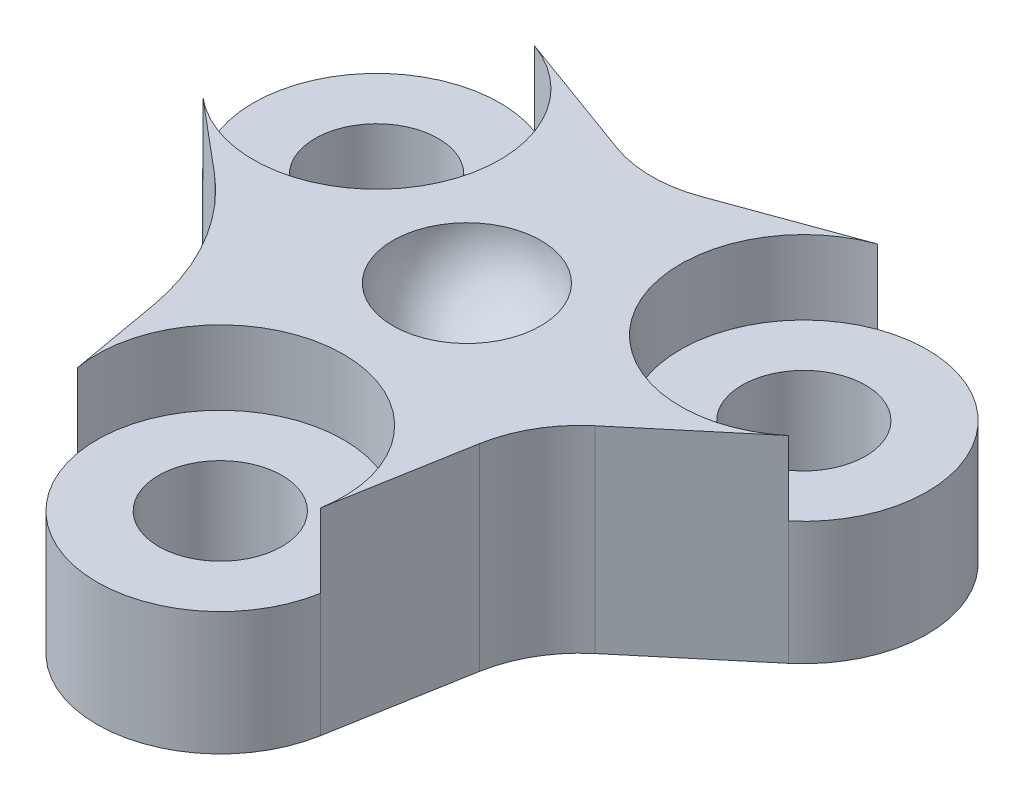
ISO-10303-21;
HEADER;
FILE_DESCRIPTION(('STEP AP214'),'2;1');
FILE_NAME('part.step','',(''),(''),'','','');
FILE_SCHEMA(('AUTOMOTIVE_DESIGN { 1 0 10303 214 1 1 1 1 }'));
ENDSEC;
DATA;
#1=APPLICATION_CONTEXT('core data for automotive mechanical design processes');
#2=APPLICATION_PROTOCOL_DEFINITION('international standard','automotive_design',2000,#1);
#3=PRODUCT_CONTEXT('',#1,'mechanical');
#4=PRODUCT('Part','Part','',(#3));
#5=PRODUCT_RELATED_PRODUCT_CATEGORY('part','',(#4));
#6=PRODUCT_DEFINITION_FORMATION('','',#4);
#7=PRODUCT_DEFINITION_CONTEXT('part definition',#1,'design');
#8=PRODUCT_DEFINITION('design','',#6,#7);
#9=PRODUCT_DEFINITION_SHAPE('','',#8);
#10=(LENGTH_UNIT() NAMED_UNIT(*) SI_UNIT(.MILLI.,.METRE.));
#11=(NAMED_UNIT(*) PLANE_ANGLE_UNIT() SI_UNIT($,.RADIAN.));
#12=(NAMED_UNIT(*) SI_UNIT($,.STERADIAN.) SOLID_ANGLE_UNIT());
#13=UNCERTAINTY_MEASURE_WITH_UNIT(LENGTH_MEASURE(1.E-05),#10,'distance_accuracy_value','');
#14=(GEOMETRIC_REPRESENTATION_CONTEXT(3) GLOBAL_UNCERTAINTY_ASSIGNED_CONTEXT((#13)) GLOBAL_UNIT_ASSIGNED_CONTEXT((#10,
#11,#12)) REPRESENTATION_CONTEXT('',''));
#15=CARTESIAN_POINT('',(0.,0.,0.));
#16=DIRECTION('',(0.,0.,1.));
#17=DIRECTION('',(1.,0.,0.));
#18=AXIS2_PLACEMENT_3D('',#15,#16,#17);
#19=CARTESIAN_POINT('',(0.,8.,10.));
#20=DIRECTION('',(0.,1.,0.));
#21=DIRECTION('',(1.,0.,0.));
#22=AXIS2_PLACEMENT_3D('',#19,#20,#21);
#23=PLANE('',#22);
#24=CARTESIAN_POINT('',(0.,8.,10.));
#25=DIRECTION('',(0.,1.,0.));
#26=DIRECTION('',(0.,0.,1.));
#27=AXIS2_PLACEMENT_3D('',#24,#25,#26);
#28=CIRCLE('',#27,5.);
#29=CARTESIAN_POINT('',(4.92403876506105,8.,10.8682408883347));
#30=VERTEX_POINT('',#29);
#31=CARTESIAN_POINT('',(-4.92403876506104,8.,10.8682408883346));
#32=VERTEX_POINT('',#31);
#33=EDGE_CURVE('E549',#30,#32,#28,.T.);
#34=ORIENTED_EDGE('',*,*,#33,.F.);
#35=DIRECTION('',(0.17364817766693,0.,-0.984807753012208));
#36=VECTOR('',#35,1.);
#37=CARTESIAN_POINT('',(4.92403876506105,8.,10.8682408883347));
#38=LINE('',#37,#36);
#39=CARTESIAN_POINT('',(5.8923613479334,8.,5.3766106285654));
#40=VERTEX_POINT('',#39);
#41=EDGE_CURVE('E220',#30,#40,#38,.T.);
#42=ORIENTED_EDGE('',*,*,#41,.T.);
#43=CARTESIAN_POINT('',(10.8164001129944,8.,6.24485151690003));
#44=DIRECTION('',(0.,-1.,0.));
#45=DIRECTION('',(-1.,0.,0.));
#46=AXIS2_PLACEMENT_3D('',#43,#44,#45);
#47=CIRCLE('',#46,5.);
#48=CARTESIAN_POINT('',(7.60246206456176,8.,2.41462930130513));
#49=VERTEX_POINT('',#48);
#50=EDGE_CURVE('E567',#40,#49,#47,.T.);
#51=ORIENTED_EDGE('',*,*,#50,.T.);
#52=DIRECTION('',(-0.766044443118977,0.,0.64278760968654));
#53=VECTOR('',#52,1.);
#54=CARTESIAN_POINT('',(11.8741920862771,8.,-1.16977778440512));
#55=LINE('',#54,#53);
#56=CARTESIAN_POINT('',(11.8741920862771,8.,-1.16977778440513));
#57=VERTEX_POINT('',#56);
#58=EDGE_CURVE('E569',#57,#49,#55,.T.);
#59=ORIENTED_EDGE('',*,*,#58,.F.);
#60=CARTESIAN_POINT('',(8.66025403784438,8.,-5.00000000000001));
#61=DIRECTION('',(0.,1.,0.));
#62=DIRECTION('',(0.,0.,1.));
#63=AXIS2_PLACEMENT_3D('',#60,#61,#62);
#64=CIRCLE('',#63,5.);
#65=CARTESIAN_POINT('',(6.95015332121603,8.,-9.69846310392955));
#66=VERTEX_POINT('',#65);
#67=EDGE_CURVE('E11',#66,#57,#64,.T.);
#68=ORIENTED_EDGE('',*,*,#67,.F.);
#69=DIRECTION('',(-0.939692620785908,0.,0.342020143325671));
#70=VECTOR('',#69,1.);
#71=CARTESIAN_POINT('',(6.95015332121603,8.,-9.69846310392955));
#72=LINE('',#71,#70);
#73=CARTESIAN_POINT('',(1.71010071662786,8.,-7.79123992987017));
#74=VERTEX_POINT('',#73);
#75=EDGE_CURVE('E573',#66,#74,#72,.T.);
#76=ORIENTED_EDGE('',*,*,#75,.T.);
#77=CARTESIAN_POINT('',(0.,8.,-12.4897030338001));
#78=DIRECTION('',(0.,-1.,0.));
#79=DIRECTION('',(-1.,0.,0.));
#80=AXIS2_PLACEMENT_3D('',#77,#78,#79);
#81=CIRCLE('',#80,5.00000000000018);
#82=CARTESIAN_POINT('',(-1.71010071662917,8.,-7.79123992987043));
#83=VERTEX_POINT('',#82);
#84=EDGE_CURVE('E169',#74,#83,#81,.T.);
#85=ORIENTED_EDGE('',*,*,#84,.T.);
#86=DIRECTION('',(0.939692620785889,0.,0.342020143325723));
#87=VECTOR('',#86,1.);
#88=CARTESIAN_POINT('',(-6.9501533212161,8.,-9.6984631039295));
#89=LINE('',#88,#87);
#90=CARTESIAN_POINT('',(-6.9501533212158,8.,-9.69846310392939));
#91=VERTEX_POINT('',#90);
#92=EDGE_CURVE('E154',#91,#83,#89,.T.);
#93=ORIENTED_EDGE('',*,*,#92,.F.);
#94=CARTESIAN_POINT('',(-8.66025403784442,8.,-4.99999999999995));
#95=DIRECTION('',(0.,1.,0.));
#96=DIRECTION('',(0.,0.,1.));
#97=AXIS2_PLACEMENT_3D('',#94,#95,#96);
#98=CIRCLE('',#97,5.);
#99=CARTESIAN_POINT('',(-11.8741920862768,8.,-1.16977778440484));
#100=VERTEX_POINT('',#99);
#101=EDGE_CURVE('E46',#100,#91,#98,.T.);
#102=ORIENTED_EDGE('',*,*,#101,.F.);
#103=DIRECTION('',(0.766044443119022,0.,0.642787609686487));
#104=VECTOR('',#103,1.);
#105=CARTESIAN_POINT('',(-11.8741920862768,8.,-1.16977778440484));
#106=LINE('',#105,#104);
#107=CARTESIAN_POINT('',(-8.99654894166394,8.,1.2448515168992));
#108=VERTEX_POINT('',#107);
#109=EDGE_CURVE('E151',#100,#108,#106,.T.);
#110=ORIENTED_EDGE('',*,*,#109,.T.);
#111=CARTESIAN_POINT('',(-15.4244250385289,8.,8.90529594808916));
#112=DIRECTION('',(0.,1.,0.));
#113=DIRECTION('',(1.,0.,0.));
#114=AXIS2_PLACEMENT_3D('',#111,#112,#113);
#115=CIRCLE('',#114,9.99999999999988);
#116=CARTESIAN_POINT('',(-5.57634750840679,8.,7.16881417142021));
#117=VERTEX_POINT('',#116);
#118=EDGE_CURVE('E161',#117,#108,#115,.T.);
#119=ORIENTED_EDGE('',*,*,#118,.F.);
#120=DIRECTION('',(-0.173648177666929,0.,-0.984807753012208));
#121=VECTOR('',#120,1.);
#122=CARTESIAN_POINT('',(-4.92403876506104,8.,10.8682408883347));
#123=LINE('',#122,#121);
#124=EDGE_CURVE('E166',#32,#117,#123,.T.);
#125=ORIENTED_EDGE('',*,*,#124,.F.);
#126=EDGE_LOOP('',(#34,#42,#51,#59,#68,#76,#85,#93,#102,#110,#119,#125));
#127=FACE_BOUND('',#126,.T.);
#128=CARTESIAN_POINT('',(0.,8.,0.));
#129=DIRECTION('',(0.,1.,0.));
#130=DIRECTION('',(0.,0.,1.));
#131=AXIS2_PLACEMENT_3D('',#128,#129,#130);
#132=CIRCLE('',#131,3.);
#133=CARTESIAN_POINT('',(0.,8.,3.));
#134=VERTEX_POINT('',#133);
#135=EDGE_CURVE('E39',#134,#134,#132,.F.);
#136=ORIENTED_EDGE('',*,*,#135,.T.);
#137=EDGE_LOOP('',(#136));
#138=FACE_BOUND('',#137,.T.);
#139=ADVANCED_FACE('F35',(#127,#138),#23,.T.);
#140=CARTESIAN_POINT('',(0.,8.,10.));
#141=DIRECTION('',(0.,-1.,0.));
#142=DIRECTION('',(0.,0.,-1.));
#143=AXIS2_PLACEMENT_3D('',#140,#141,#142);
#144=CYLINDRICAL_SURFACE('',#143,5.);
#145=CARTESIAN_POINT('',(0.,5.,10.));
#146=DIRECTION('',(0.,1.,0.));
#147=DIRECTION('',(0.,0.,1.));
#148=AXIS2_PLACEMENT_3D('',#145,#146,#147);
#149=CIRCLE('',#148,5.);
#150=CARTESIAN_POINT('',(-4.92403876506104,5.,10.8682408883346));
#151=VERTEX_POINT('',#150);
#152=CARTESIAN_POINT('',(4.92403876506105,5.,10.8682408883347));
#153=VERTEX_POINT('',#152);
#154=EDGE_CURVE('E273',#151,#153,#149,.T.);
#155=ORIENTED_EDGE('',*,*,#154,.F.);
#156=DIRECTION('',(0.,-1.,0.));
#157=VECTOR('',#156,1.);
#158=CARTESIAN_POINT('',(-4.92403876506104,8.,10.8682408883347));
#159=LINE('',#158,#157);
#160=CARTESIAN_POINT('',(-4.92403876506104,0.,10.8682408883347));
#161=VERTEX_POINT('',#160);
#162=EDGE_CURVE('E101',#151,#161,#159,.T.);
#163=ORIENTED_EDGE('',*,*,#162,.T.);
#164=CARTESIAN_POINT('',(0.,0.,10.));
#165=DIRECTION('',(0.,1.,0.));
#166=DIRECTION('',(1.,0.,0.));
#167=AXIS2_PLACEMENT_3D('',#164,#165,#166);
#168=CIRCLE('',#167,5.);
#169=CARTESIAN_POINT('',(4.92403876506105,0.,10.8682408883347));
#170=VERTEX_POINT('',#169);
#171=EDGE_CURVE('E175',#161,#170,#168,.T.);
#172=ORIENTED_EDGE('',*,*,#171,.T.);
#173=DIRECTION('',(0.,-1.,0.));
#174=VECTOR('',#173,1.);
#175=CARTESIAN_POINT('',(4.92403876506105,8.,10.8682408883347));
#176=LINE('',#175,#174);
#177=EDGE_CURVE('E256',#153,#170,#176,.T.);
#178=ORIENTED_EDGE('',*,*,#177,.F.);
#179=EDGE_LOOP('',(#155,#163,#172,#178));
#180=FACE_BOUND('',#179,.T.);
#181=ADVANCED_FACE('F37',(#180),#144,.T.);
#182=CARTESIAN_POINT('',(8.66025403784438,8.,-5.00000000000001));
#183=DIRECTION('',(0.,-1.,0.));
#184=DIRECTION('',(0.,0.,-1.));
#185=AXIS2_PLACEMENT_3D('',#182,#183,#184);
#186=CYLINDRICAL_SURFACE('',#185,5.);
#187=CARTESIAN_POINT('',(8.66025403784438,5.,-5.00000000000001));
#188=DIRECTION('',(0.,1.,0.));
#189=DIRECTION('',(0.,0.,1.));
#190=AXIS2_PLACEMENT_3D('',#187,#188,#189);
#191=CIRCLE('',#190,5.);
#192=CARTESIAN_POINT('',(11.8741920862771,5.,-1.16977778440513));
#193=VERTEX_POINT('',#192);
#194=CARTESIAN_POINT('',(6.95015332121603,5.,-9.69846310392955));
#195=VERTEX_POINT('',#194);
#196=EDGE_CURVE('E560',#193,#195,#191,.T.);
#197=ORIENTED_EDGE('',*,*,#196,.F.);
#198=DIRECTION('',(0.,-1.,0.));
#199=VECTOR('',#198,1.);
#200=CARTESIAN_POINT('',(11.8741920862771,8.,-1.16977778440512));
#201=LINE('',#200,#199);
#202=CARTESIAN_POINT('',(11.8741920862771,0.,-1.16977778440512));
#203=VERTEX_POINT('',#202);
#204=EDGE_CURVE('E244',#193,#203,#201,.T.);
#205=ORIENTED_EDGE('',*,*,#204,.T.);
#206=CARTESIAN_POINT('',(8.66025403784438,0.,-5.00000000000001));
#207=DIRECTION('',(0.,1.,0.));
#208=DIRECTION('',(1.,0.,0.));
#209=AXIS2_PLACEMENT_3D('',#206,#207,#208);
#210=CIRCLE('',#209,5.);
#211=CARTESIAN_POINT('',(6.95015332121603,0.,-9.69846310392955));
#212=VERTEX_POINT('',#211);
#213=EDGE_CURVE('E190',#203,#212,#210,.T.);
#214=ORIENTED_EDGE('',*,*,#213,.T.);
#215=DIRECTION('',(0.,-1.,0.));
#216=VECTOR('',#215,1.);
#217=CARTESIAN_POINT('',(6.95015332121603,8.,-9.69846310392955));
#218=LINE('',#217,#216);
#219=EDGE_CURVE('E239',#195,#212,#218,.T.);
#220=ORIENTED_EDGE('',*,*,#219,.F.);
#221=EDGE_LOOP('',(#197,#205,#214,#220));
#222=FACE_BOUND('',#221,.T.);
#223=ADVANCED_FACE('F275',(#222),#186,.T.);
#224=CARTESIAN_POINT('',(-8.66025403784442,8.,-4.99999999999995));
#225=DIRECTION('',(0.,-1.,0.));
#226=DIRECTION('',(0.,0.,-1.));
#227=AXIS2_PLACEMENT_3D('',#224,#225,#226);
#228=CYLINDRICAL_SURFACE('',#227,5.);
#229=CARTESIAN_POINT('',(-8.66025403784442,5.,-4.99999999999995));
#230=DIRECTION('',(0.,1.,0.));
#231=DIRECTION('',(0.,0.,1.));
#232=AXIS2_PLACEMENT_3D('',#229,#230,#231);
#233=CIRCLE('',#232,5.);
#234=CARTESIAN_POINT('',(-6.9501533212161,5.,-9.6984631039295));
#235=VERTEX_POINT('',#234);
#236=CARTESIAN_POINT('',(-11.8741920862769,5.,-1.16977778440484));
#237=VERTEX_POINT('',#236);
#238=EDGE_CURVE('E179',#235,#237,#233,.T.);
#239=ORIENTED_EDGE('',*,*,#238,.F.);
#240=DIRECTION('',(0.,-1.,0.));
#241=VECTOR('',#240,1.);
#242=CARTESIAN_POINT('',(-6.9501533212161,8.,-9.6984631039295));
#243=LINE('',#242,#241);
#244=CARTESIAN_POINT('',(-6.9501533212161,0.,-9.6984631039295));
#245=VERTEX_POINT('',#244);
#246=EDGE_CURVE('E145',#235,#245,#243,.T.);
#247=ORIENTED_EDGE('',*,*,#246,.T.);
#248=CARTESIAN_POINT('',(-8.66025403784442,0.,-4.99999999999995));
#249=DIRECTION('',(0.,1.,0.));
#250=DIRECTION('',(1.,0.,0.));
#251=AXIS2_PLACEMENT_3D('',#248,#249,#250);
#252=CIRCLE('',#251,5.);
#253=CARTESIAN_POINT('',(-11.8741920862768,0.,-1.16977778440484));
#254=VERTEX_POINT('',#253);
#255=EDGE_CURVE('E205',#245,#254,#252,.T.);
#256=ORIENTED_EDGE('',*,*,#255,.T.);
#257=DIRECTION('',(0.,-1.,0.));
#258=VECTOR('',#257,1.);
#259=CARTESIAN_POINT('',(-11.8741920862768,8.,-1.16977778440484));
#260=LINE('',#259,#258);
#261=EDGE_CURVE('E146',#237,#254,#260,.T.);
#262=ORIENTED_EDGE('',*,*,#261,.F.);
#263=EDGE_LOOP('',(#239,#247,#256,#262));
#264=FACE_BOUND('',#263,.T.);
#265=ADVANCED_FACE('F280',(#264),#228,.T.);
#266=CARTESIAN_POINT('',(4.92403876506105,8.,10.8682408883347));
#267=DIRECTION('',(-0.984807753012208,0.,-0.17364817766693));
#268=DIRECTION('',(-0.17364817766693,0.,0.984807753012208));
#269=AXIS2_PLACEMENT_3D('',#266,#267,#268);
#270=PLANE('',#269);
#271=DIRECTION('',(0.17364817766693,0.,-0.984807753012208));
#272=VECTOR('',#271,1.);
#273=CARTESIAN_POINT('',(4.92403876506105,0.,10.8682408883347));
#274=LINE('',#273,#272);
#275=CARTESIAN_POINT('',(5.8923613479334,0.,5.3766106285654));
#276=VERTEX_POINT('',#275);
#277=EDGE_CURVE('E178',#170,#276,#274,.T.);
#278=ORIENTED_EDGE('',*,*,#277,.T.);
#279=DIRECTION('',(0.,-1.,0.));
#280=VECTOR('',#279,1.);
#281=CARTESIAN_POINT('',(5.8923613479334,8.,5.3766106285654));
#282=LINE('',#281,#280);
#283=EDGE_CURVE('E252',#40,#276,#282,.T.);
#284=ORIENTED_EDGE('',*,*,#283,.F.);
#285=ORIENTED_EDGE('',*,*,#41,.F.);
#286=EDGE_CURVE('E110',#30,#153,#176,.T.);
#287=ORIENTED_EDGE('',*,*,#286,.T.);
#288=ORIENTED_EDGE('',*,*,#177,.T.);
#289=EDGE_LOOP('',(#278,#284,#285,#287,#288));
#290=FACE_BOUND('',#289,.T.);
#291=ADVANCED_FACE('F266',(#290),#270,.F.);
#292=CARTESIAN_POINT('',(10.8164001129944,8.,6.24485151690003));
#293=DIRECTION('',(0.,-1.,0.));
#294=DIRECTION('',(0.,0.,-1.));
#295=AXIS2_PLACEMENT_3D('',#292,#293,#294);
#296=CYLINDRICAL_SURFACE('',#295,5.);
#297=CARTESIAN_POINT('',(10.8164001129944,0.,6.24485151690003));
#298=DIRECTION('',(0.,-1.,0.));
#299=DIRECTION('',(-1.,0.,0.));
#300=AXIS2_PLACEMENT_3D('',#297,#298,#299);
#301=CIRCLE('',#300,5.);
#302=CARTESIAN_POINT('',(7.60246206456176,0.,2.41462930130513));
#303=VERTEX_POINT('',#302);
#304=EDGE_CURVE('E182',#276,#303,#301,.T.);
#305=ORIENTED_EDGE('',*,*,#304,.T.);
#306=DIRECTION('',(0.,-1.,0.));
#307=VECTOR('',#306,1.);
#308=CARTESIAN_POINT('',(7.60246206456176,8.,2.41462930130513));
#309=LINE('',#308,#307);
#310=EDGE_CURVE('E249',#49,#303,#309,.T.);
#311=ORIENTED_EDGE('',*,*,#310,.F.);
#312=ORIENTED_EDGE('',*,*,#50,.F.);
#313=ORIENTED_EDGE('',*,*,#283,.T.);
#314=EDGE_LOOP('',(#305,#311,#312,#313));
#315=FACE_BOUND('',#314,.T.);
#316=ADVANCED_FACE('F318',(#315),#296,.F.);
#317=CARTESIAN_POINT('',(11.8741920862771,8.,-1.16977778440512));
#318=DIRECTION('',(0.64278760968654,0.,0.766044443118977));
#319=DIRECTION('',(0.766044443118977,0.,-0.64278760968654));
#320=AXIS2_PLACEMENT_3D('',#317,#318,#319);
#321=PLANE('',#320);
#322=DIRECTION('',(-0.766044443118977,0.,0.64278760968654));
#323=VECTOR('',#322,1.);
#324=CARTESIAN_POINT('',(11.8741920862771,0.,-1.16977778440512));
#325=LINE('',#324,#323);
#326=EDGE_CURVE('E186',#203,#303,#325,.T.);
#327=ORIENTED_EDGE('',*,*,#326,.F.);
#328=ORIENTED_EDGE('',*,*,#204,.F.);
#329=EDGE_CURVE('E245',#57,#193,#201,.T.);
#330=ORIENTED_EDGE('',*,*,#329,.F.);
#331=ORIENTED_EDGE('',*,*,#58,.T.);
#332=ORIENTED_EDGE('',*,*,#310,.T.);
#333=EDGE_LOOP('',(#327,#328,#330,#331,#332));
#334=FACE_BOUND('',#333,.T.);
#335=ADVANCED_FACE('F313',(#334),#321,.T.);
#336=CARTESIAN_POINT('',(6.95015332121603,8.,-9.69846310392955));
#337=DIRECTION('',(0.342020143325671,0.,0.939692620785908));
#338=DIRECTION('',(0.939692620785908,0.,-0.342020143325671));
#339=AXIS2_PLACEMENT_3D('',#336,#337,#338);
#340=PLANE('',#339);
#341=DIRECTION('',(-0.939692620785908,0.,0.342020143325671));
#342=VECTOR('',#341,1.);
#343=CARTESIAN_POINT('',(6.95015332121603,0.,-9.69846310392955));
#344=LINE('',#343,#342);
#345=CARTESIAN_POINT('',(1.71010071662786,0.,-7.79123992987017));
#346=VERTEX_POINT('',#345);
#347=EDGE_CURVE('E194',#212,#346,#344,.T.);
#348=ORIENTED_EDGE('',*,*,#347,.T.);
#349=DIRECTION('',(0.,-1.,0.));
#350=VECTOR('',#349,1.);
#351=CARTESIAN_POINT('',(1.71010071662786,8.,-7.79123992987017));
#352=LINE('',#351,#350);
#353=EDGE_CURVE('E235',#74,#346,#352,.T.);
#354=ORIENTED_EDGE('',*,*,#353,.F.);
#355=ORIENTED_EDGE('',*,*,#75,.F.);
#356=EDGE_CURVE('E240',#66,#195,#218,.T.);
#357=ORIENTED_EDGE('',*,*,#356,.T.);
#358=ORIENTED_EDGE('',*,*,#219,.T.);
#359=EDGE_LOOP('',(#348,#354,#355,#357,#358));
#360=FACE_BOUND('',#359,.T.);
#361=ADVANCED_FACE('F310',(#360),#340,.F.);
#362=CARTESIAN_POINT('',(0.,8.,-12.4897030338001));
#363=DIRECTION('',(0.,-1.,0.));
#364=DIRECTION('',(0.,0.,-1.));
#365=AXIS2_PLACEMENT_3D('',#362,#363,#364);
#366=CYLINDRICAL_SURFACE('',#365,5.00000000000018);
#367=CARTESIAN_POINT('',(0.,0.,-12.4897030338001));
#368=DIRECTION('',(0.,-1.,0.));
#369=DIRECTION('',(-1.,0.,0.));
#370=AXIS2_PLACEMENT_3D('',#367,#368,#369);
#371=CIRCLE('',#370,5.00000000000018);
#372=CARTESIAN_POINT('',(-1.71010071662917,0.,-7.79123992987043));
#373=VERTEX_POINT('',#372);
#374=EDGE_CURVE('E197',#346,#373,#371,.T.);
#375=ORIENTED_EDGE('',*,*,#374,.T.);
#376=DIRECTION('',(0.,-1.,0.));
#377=VECTOR('',#376,1.);
#378=CARTESIAN_POINT('',(-1.71010071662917,8.,-7.79123992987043));
#379=LINE('',#378,#377);
#380=EDGE_CURVE('E232',#83,#373,#379,.T.);
#381=ORIENTED_EDGE('',*,*,#380,.F.);
#382=ORIENTED_EDGE('',*,*,#84,.F.);
#383=ORIENTED_EDGE('',*,*,#353,.T.);
#384=EDGE_LOOP('',(#375,#381,#382,#383));
#385=FACE_BOUND('',#384,.T.);
#386=ADVANCED_FACE('F306',(#385),#366,.F.);
#387=CARTESIAN_POINT('',(-6.9501533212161,8.,-9.6984631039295));
#388=DIRECTION('',(0.342020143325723,0.,-0.939692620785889));
#389=DIRECTION('',(-0.939692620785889,0.,-0.342020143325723));
#390=AXIS2_PLACEMENT_3D('',#387,#388,#389);
#391=PLANE('',#390);
#392=DIRECTION('',(0.939692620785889,0.,0.342020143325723));
#393=VECTOR('',#392,1.);
#394=CARTESIAN_POINT('',(-6.9501533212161,0.,-9.6984631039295));
#395=LINE('',#394,#393);
#396=EDGE_CURVE('E201',#245,#373,#395,.T.);
#397=ORIENTED_EDGE('',*,*,#396,.F.);
#398=ORIENTED_EDGE('',*,*,#246,.F.);
#399=EDGE_CURVE('E229',#91,#235,#243,.T.);
#400=ORIENTED_EDGE('',*,*,#399,.F.);
#401=ORIENTED_EDGE('',*,*,#92,.T.);
#402=ORIENTED_EDGE('',*,*,#380,.T.);
#403=EDGE_LOOP('',(#397,#398,#400,#401,#402));
#404=FACE_BOUND('',#403,.T.);
#405=ADVANCED_FACE('F300',(#404),#391,.T.);
#406=CARTESIAN_POINT('',(-11.8741920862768,8.,-1.16977778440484));
#407=DIRECTION('',(0.642787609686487,0.,-0.766044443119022));
#408=DIRECTION('',(-0.766044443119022,0.,-0.642787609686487));
#409=AXIS2_PLACEMENT_3D('',#406,#407,#408);
#410=PLANE('',#409);
#411=DIRECTION('',(0.766044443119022,0.,0.642787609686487));
#412=VECTOR('',#411,1.);
#413=CARTESIAN_POINT('',(-11.8741920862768,0.,-1.16977778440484));
#414=LINE('',#413,#412);
#415=CARTESIAN_POINT('',(-8.99654894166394,0.,1.2448515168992));
#416=VERTEX_POINT('',#415);
#417=EDGE_CURVE('E209',#254,#416,#414,.T.);
#418=ORIENTED_EDGE('',*,*,#417,.T.);
#419=DIRECTION('',(0.,-1.,0.));
#420=VECTOR('',#419,1.);
#421=CARTESIAN_POINT('',(-8.99654894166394,8.,1.2448515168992));
#422=LINE('',#421,#420);
#423=EDGE_CURVE('E159',#108,#416,#422,.T.);
#424=ORIENTED_EDGE('',*,*,#423,.F.);
#425=ORIENTED_EDGE('',*,*,#109,.F.);
#426=EDGE_CURVE('E133',#100,#237,#260,.T.);
#427=ORIENTED_EDGE('',*,*,#426,.T.);
#428=ORIENTED_EDGE('',*,*,#261,.T.);
#429=EDGE_LOOP('',(#418,#424,#425,#427,#428));
#430=FACE_BOUND('',#429,.T.);
#431=ADVANCED_FACE('F158',(#430),#410,.F.);
#432=CARTESIAN_POINT('',(-15.4244250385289,8.,8.90529594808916));
#433=DIRECTION('',(0.,-1.,0.));
#434=DIRECTION('',(0.,0.,-1.));
#435=AXIS2_PLACEMENT_3D('',#432,#433,#434);
#436=CYLINDRICAL_SURFACE('',#435,9.99999999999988);
#437=CARTESIAN_POINT('',(-15.4244250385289,0.,8.90529594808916));
#438=DIRECTION('',(0.,1.,0.));
#439=DIRECTION('',(1.,0.,0.));
#440=AXIS2_PLACEMENT_3D('',#437,#438,#439);
#441=CIRCLE('',#440,9.99999999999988);
#442=CARTESIAN_POINT('',(-5.57634750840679,0.,7.16881417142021));
#443=VERTEX_POINT('',#442);
#444=EDGE_CURVE('E212',#443,#416,#441,.T.);
#445=ORIENTED_EDGE('',*,*,#444,.F.);
#446=DIRECTION('',(0.,-1.,0.));
#447=VECTOR('',#446,1.);
#448=CARTESIAN_POINT('',(-5.57634750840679,8.,7.16881417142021));
#449=LINE('',#448,#447);
#450=EDGE_CURVE('E54',#117,#443,#449,.T.);
#451=ORIENTED_EDGE('',*,*,#450,.F.);
#452=ORIENTED_EDGE('',*,*,#118,.T.);
#453=ORIENTED_EDGE('',*,*,#423,.T.);
#454=EDGE_LOOP('',(#445,#451,#452,#453));
#455=FACE_BOUND('',#454,.T.);
#456=ADVANCED_FACE('F295',(#455),#436,.F.);
#457=CARTESIAN_POINT('',(-4.92403876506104,8.,10.8682408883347));
#458=DIRECTION('',(-0.984807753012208,0.,0.173648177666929));
#459=DIRECTION('',(0.173648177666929,0.,0.984807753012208));
#460=AXIS2_PLACEMENT_3D('',#457,#458,#459);
#461=PLANE('',#460);
#462=DIRECTION('',(-0.173648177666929,0.,-0.984807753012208));
#463=VECTOR('',#462,1.);
#464=CARTESIAN_POINT('',(-4.92403876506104,0.,10.8682408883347));
#465=LINE('',#464,#463);
#466=EDGE_CURVE('E216',#161,#443,#465,.T.);
#467=ORIENTED_EDGE('',*,*,#466,.F.);
#468=ORIENTED_EDGE('',*,*,#162,.F.);
#469=EDGE_CURVE('E221',#32,#151,#159,.T.);
#470=ORIENTED_EDGE('',*,*,#469,.F.);
#471=ORIENTED_EDGE('',*,*,#124,.T.);
#472=ORIENTED_EDGE('',*,*,#450,.T.);
#473=EDGE_LOOP('',(#467,#468,#470,#471,#472));
#474=FACE_BOUND('',#473,.T.);
#475=ADVANCED_FACE('F291',(#474),#461,.T.);
#476=CARTESIAN_POINT('',(0.,0.,10.));
#477=DIRECTION('',(0.,1.,0.));
#478=DIRECTION('',(1.,0.,0.));
#479=AXIS2_PLACEMENT_3D('',#476,#477,#478);
#480=PLANE('',#479);
#481=CARTESIAN_POINT('',(-8.66025403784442,0.,-4.99999999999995));
#482=DIRECTION('',(0.,1.,0.));
#483=DIRECTION('',(0.,0.,1.));
#484=AXIS2_PLACEMENT_3D('',#481,#482,#483);
#485=CIRCLE('',#484,2.5);
#486=CARTESIAN_POINT('',(-8.66025403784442,0.,-2.49999999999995));
#487=VERTEX_POINT('',#486);
#488=EDGE_CURVE('E527',#487,#487,#485,.T.);
#489=ORIENTED_EDGE('',*,*,#488,.T.);
#490=EDGE_LOOP('',(#489));
#491=FACE_BOUND('',#490,.T.);
#492=CARTESIAN_POINT('',(8.66025403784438,0.,-5.00000000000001));
#493=DIRECTION('',(0.,1.,0.));
#494=DIRECTION('',(0.,0.,1.));
#495=AXIS2_PLACEMENT_3D('',#492,#493,#494);
#496=CIRCLE('',#495,2.5);
#497=CARTESIAN_POINT('',(8.66025403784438,0.,-2.50000000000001));
#498=VERTEX_POINT('',#497);
#499=EDGE_CURVE('E537',#498,#498,#496,.T.);
#500=ORIENTED_EDGE('',*,*,#499,.T.);
#501=EDGE_LOOP('',(#500));
#502=FACE_BOUND('',#501,.T.);
#503=CARTESIAN_POINT('',(0.,0.,10.));
#504=DIRECTION('',(0.,1.,0.));
#505=DIRECTION('',(0.,0.,1.));
#506=AXIS2_PLACEMENT_3D('',#503,#504,#505);
#507=CIRCLE('',#506,2.5);
#508=CARTESIAN_POINT('',(0.,0.,12.5));
#509=VERTEX_POINT('',#508);
#510=EDGE_CURVE('E545',#509,#509,#507,.T.);
#511=ORIENTED_EDGE('',*,*,#510,.T.);
#512=EDGE_LOOP('',(#511));
#513=FACE_BOUND('',#512,.T.);
#514=ORIENTED_EDGE('',*,*,#171,.F.);
#515=ORIENTED_EDGE('',*,*,#466,.T.);
#516=ORIENTED_EDGE('',*,*,#444,.T.);
#517=ORIENTED_EDGE('',*,*,#417,.F.);
#518=ORIENTED_EDGE('',*,*,#255,.F.);
#519=ORIENTED_EDGE('',*,*,#396,.T.);
#520=ORIENTED_EDGE('',*,*,#374,.F.);
#521=ORIENTED_EDGE('',*,*,#347,.F.);
#522=ORIENTED_EDGE('',*,*,#213,.F.);
#523=ORIENTED_EDGE('',*,*,#326,.T.);
#524=ORIENTED_EDGE('',*,*,#304,.F.);
#525=ORIENTED_EDGE('',*,*,#277,.F.);
#526=EDGE_LOOP('',(#514,#515,#516,#517,#518,#519,#520,#521,#522,#523,#524,#525));
#527=FACE_BOUND('',#526,.T.);
#528=ADVANCED_FACE('F270',(#491,#502,#513,#527),#480,.F.);
#529=CARTESIAN_POINT('',(-8.66025403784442,5.,-4.99999999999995));
#530=DIRECTION('',(0.,1.,0.));
#531=DIRECTION('',(0.,0.,1.));
#532=AXIS2_PLACEMENT_3D('',#529,#530,#531);
#533=CYLINDRICAL_SURFACE('',#532,5.);
#534=EDGE_CURVE('E140',#237,#235,#233,.T.);
#535=ORIENTED_EDGE('',*,*,#534,.F.);
#536=ORIENTED_EDGE('',*,*,#426,.F.);
#537=ORIENTED_EDGE('',*,*,#101,.T.);
#538=ORIENTED_EDGE('',*,*,#399,.T.);
#539=EDGE_LOOP('',(#535,#536,#537,#538));
#540=FACE_BOUND('',#539,.T.);
#541=ADVANCED_FACE('F135',(#540),#533,.F.);
#542=CARTESIAN_POINT('',(-8.66025403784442,5.,-4.99999999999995));
#543=DIRECTION('',(0.,1.,0.));
#544=DIRECTION('',(0.,0.,1.));
#545=AXIS2_PLACEMENT_3D('',#542,#543,#544);
#546=PLANE('',#545);
#547=CARTESIAN_POINT('',(-8.66025403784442,5.,-4.99999999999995));
#548=DIRECTION('',(0.,1.,0.));
#549=DIRECTION('',(0.,0.,1.));
#550=AXIS2_PLACEMENT_3D('',#547,#548,#549);
#551=CIRCLE('',#550,2.5);
#552=CARTESIAN_POINT('',(-8.66025403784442,5.,-2.49999999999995));
#553=VERTEX_POINT('',#552);
#554=EDGE_CURVE('E524',#553,#553,#551,.T.);
#555=ORIENTED_EDGE('',*,*,#554,.F.);
#556=EDGE_LOOP('',(#555));
#557=FACE_BOUND('',#556,.T.);
#558=ORIENTED_EDGE('',*,*,#238,.T.);
#559=ORIENTED_EDGE('',*,*,#534,.T.);
#560=EDGE_LOOP('',(#558,#559));
#561=FACE_BOUND('',#560,.T.);
#562=ADVANCED_FACE('F359',(#557,#561),#546,.T.);
#563=CARTESIAN_POINT('',(8.66025403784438,5.,-5.00000000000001));
#564=DIRECTION('',(0.,1.,0.));
#565=DIRECTION('',(0.,0.,1.));
#566=AXIS2_PLACEMENT_3D('',#563,#564,#565);
#567=CYLINDRICAL_SURFACE('',#566,5.);
#568=EDGE_CURVE('E557',#195,#193,#191,.T.);
#569=ORIENTED_EDGE('',*,*,#568,.F.);
#570=ORIENTED_EDGE('',*,*,#356,.F.);
#571=ORIENTED_EDGE('',*,*,#67,.T.);
#572=ORIENTED_EDGE('',*,*,#329,.T.);
#573=EDGE_LOOP('',(#569,#570,#571,#572));
#574=FACE_BOUND('',#573,.T.);
#575=ADVANCED_FACE('F364',(#574),#567,.F.);
#576=CARTESIAN_POINT('',(8.66025403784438,5.,-5.00000000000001));
#577=DIRECTION('',(0.,1.,0.));
#578=DIRECTION('',(0.,0.,1.));
#579=AXIS2_PLACEMENT_3D('',#576,#577,#578);
#580=PLANE('',#579);
#581=CARTESIAN_POINT('',(8.66025403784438,5.,-5.00000000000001));
#582=DIRECTION('',(0.,1.,0.));
#583=DIRECTION('',(0.,0.,1.));
#584=AXIS2_PLACEMENT_3D('',#581,#582,#583);
#585=CIRCLE('',#584,2.5);
#586=CARTESIAN_POINT('',(8.66025403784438,5.,-2.50000000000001));
#587=VERTEX_POINT('',#586);
#588=EDGE_CURVE('E534',#587,#587,#585,.T.);
#589=ORIENTED_EDGE('',*,*,#588,.F.);
#590=EDGE_LOOP('',(#589));
#591=FACE_BOUND('',#590,.T.);
#592=ORIENTED_EDGE('',*,*,#196,.T.);
#593=ORIENTED_EDGE('',*,*,#568,.T.);
#594=EDGE_LOOP('',(#592,#593));
#595=FACE_BOUND('',#594,.T.);
#596=ADVANCED_FACE('F370',(#591,#595),#580,.T.);
#597=CARTESIAN_POINT('',(0.,5.,10.));
#598=DIRECTION('',(0.,1.,0.));
#599=DIRECTION('',(0.,0.,1.));
#600=AXIS2_PLACEMENT_3D('',#597,#598,#599);
#601=CYLINDRICAL_SURFACE('',#600,5.);
#602=ORIENTED_EDGE('',*,*,#286,.F.);
#603=ORIENTED_EDGE('',*,*,#33,.T.);
#604=ORIENTED_EDGE('',*,*,#469,.T.);
#605=EDGE_CURVE('E553',#153,#151,#149,.T.);
#606=ORIENTED_EDGE('',*,*,#605,.F.);
#607=EDGE_LOOP('',(#602,#603,#604,#606));
#608=FACE_BOUND('',#607,.T.);
#609=ADVANCED_FACE('F377',(#608),#601,.F.);
#610=CARTESIAN_POINT('',(0.,5.,10.));
#611=DIRECTION('',(0.,1.,0.));
#612=DIRECTION('',(0.,0.,1.));
#613=AXIS2_PLACEMENT_3D('',#610,#611,#612);
#614=PLANE('',#613);
#615=CARTESIAN_POINT('',(0.,5.,10.));
#616=DIRECTION('',(0.,1.,0.));
#617=DIRECTION('',(0.,0.,1.));
#618=AXIS2_PLACEMENT_3D('',#615,#616,#617);
#619=CIRCLE('',#618,2.5);
#620=CARTESIAN_POINT('',(0.,5.,12.5));
#621=VERTEX_POINT('',#620);
#622=EDGE_CURVE('E541',#621,#621,#619,.T.);
#623=ORIENTED_EDGE('',*,*,#622,.F.);
#624=EDGE_LOOP('',(#623));
#625=FACE_BOUND('',#624,.T.);
#626=ORIENTED_EDGE('',*,*,#605,.T.);
#627=ORIENTED_EDGE('',*,*,#154,.T.);
#628=EDGE_LOOP('',(#626,#627));
#629=FACE_BOUND('',#628,.T.);
#630=ADVANCED_FACE('F384',(#625,#629),#614,.T.);
#631=CARTESIAN_POINT('',(0.,0.,10.));
#632=DIRECTION('',(0.,1.,0.));
#633=DIRECTION('',(0.,0.,1.));
#634=AXIS2_PLACEMENT_3D('',#631,#632,#633);
#635=CYLINDRICAL_SURFACE('',#634,2.5);
#636=ORIENTED_EDGE('',*,*,#510,.F.);
#637=EDGE_LOOP('',(#636));
#638=FACE_BOUND('',#637,.T.);
#639=ORIENTED_EDGE('',*,*,#622,.T.);
#640=EDGE_LOOP('',(#639));
#641=FACE_BOUND('',#640,.T.);
#642=ADVANCED_FACE('F390',(#638,#641),#635,.F.);
#643=CARTESIAN_POINT('',(8.66025403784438,0.,-5.00000000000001));
#644=DIRECTION('',(0.,1.,0.));
#645=DIRECTION('',(0.,0.,1.));
#646=AXIS2_PLACEMENT_3D('',#643,#644,#645);
#647=CYLINDRICAL_SURFACE('',#646,2.5);
#648=ORIENTED_EDGE('',*,*,#499,.F.);
#649=EDGE_LOOP('',(#648));
#650=FACE_BOUND('',#649,.T.);
#651=ORIENTED_EDGE('',*,*,#588,.T.);
#652=EDGE_LOOP('',(#651));
#653=FACE_BOUND('',#652,.T.);
#654=ADVANCED_FACE('F397',(#650,#653),#647,.F.);
#655=CARTESIAN_POINT('',(-8.66025403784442,0.,-4.99999999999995));
#656=DIRECTION('',(0.,1.,0.));
#657=DIRECTION('',(0.,0.,1.));
#658=AXIS2_PLACEMENT_3D('',#655,#656,#657);
#659=CYLINDRICAL_SURFACE('',#658,2.5);
#660=ORIENTED_EDGE('',*,*,#488,.F.);
#661=EDGE_LOOP('',(#660));
#662=FACE_BOUND('',#661,.T.);
#663=ORIENTED_EDGE('',*,*,#554,.T.);
#664=EDGE_LOOP('',(#663));
#665=FACE_BOUND('',#664,.T.);
#666=ADVANCED_FACE('F404',(#662,#665),#659,.F.);
#667=CARTESIAN_POINT('',(0.,8.,0.));
#668=DIRECTION('',(0.,0.,-1.));
#669=DIRECTION('',(1.,0.,0.));
#670=AXIS2_PLACEMENT_3D('',#667,#668,#669);
#671=SPHERICAL_SURFACE('',#670,3.);
#672=CARTESIAN_POINT('',(0.,8.,0.));
#673=DIRECTION('',(0.,1.,0.));
#674=DIRECTION('',(0.,0.,1.));
#675=AXIS2_PLACEMENT_3D('',#672,#673,#674);
#676=SPHERICAL_SURFACE('',#675,3.);
#677=ORIENTED_EDGE('',*,*,#135,.F.);
#678=EDGE_LOOP('',(#677));
#679=FACE_BOUND('',#678,.T.);
#680=ADVANCED_FACE('F411',(#679),#676,.F.);
#681=CLOSED_SHELL('',(#139,#181,#223,#265,#291,#316,#335,#361,#386,#405,#431,#456,#475,#528,
#541,#562,#575,#596,#609,#630,#642,#654,#666,#680));
#682=MANIFOLD_SOLID_BREP('B2',#681);
#683=ADVANCED_BREP_SHAPE_REPRESENTATION('',(#18,#682),#14);
#684=SHAPE_DEFINITION_REPRESENTATION(#9,#683);
ENDSEC;
END-ISO-10303-21;
